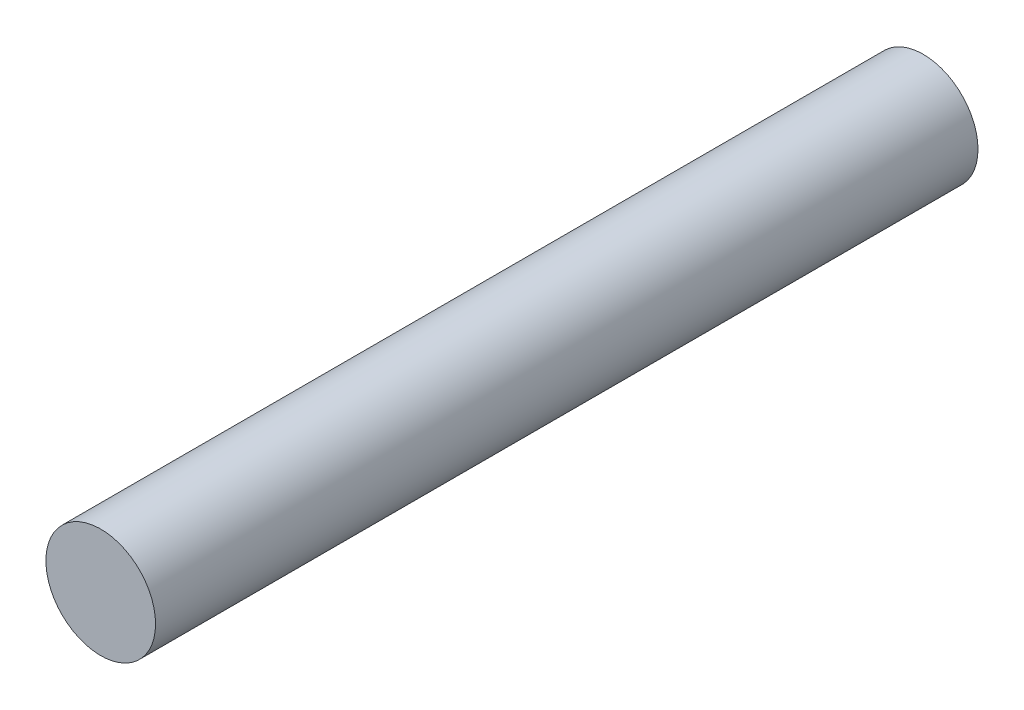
ISO-10303-21;
HEADER;
FILE_DESCRIPTION(('STEP AP214'),'2;1');
FILE_NAME('part.step','',(''),(''),'','','');
FILE_SCHEMA(('AUTOMOTIVE_DESIGN { 1 0 10303 214 1 1 1 1 }'));
ENDSEC;
DATA;
#1=APPLICATION_CONTEXT('core data for automotive mechanical design processes');
#2=APPLICATION_PROTOCOL_DEFINITION('international standard','automotive_design',2000,#1);
#3=PRODUCT_CONTEXT('',#1,'mechanical');
#4=PRODUCT('Part','Part','',(#3));
#5=PRODUCT_RELATED_PRODUCT_CATEGORY('part','',(#4));
#6=PRODUCT_DEFINITION_FORMATION('','',#4);
#7=PRODUCT_DEFINITION_CONTEXT('part definition',#1,'design');
#8=PRODUCT_DEFINITION('design','',#6,#7);
#9=PRODUCT_DEFINITION_SHAPE('','',#8);
#10=(LENGTH_UNIT() NAMED_UNIT(*) SI_UNIT(.MILLI.,.METRE.));
#11=(NAMED_UNIT(*) PLANE_ANGLE_UNIT() SI_UNIT($,.RADIAN.));
#12=(NAMED_UNIT(*) SI_UNIT($,.STERADIAN.) SOLID_ANGLE_UNIT());
#13=UNCERTAINTY_MEASURE_WITH_UNIT(LENGTH_MEASURE(1.E-05),#10,'distance_accuracy_value','');
#14=(GEOMETRIC_REPRESENTATION_CONTEXT(3) GLOBAL_UNCERTAINTY_ASSIGNED_CONTEXT((#13)) GLOBAL_UNIT_ASSIGNED_CONTEXT((#10,
#11,#12)) REPRESENTATION_CONTEXT('',''));
#15=CARTESIAN_POINT('',(0.,0.,0.));
#16=DIRECTION('',(0.,0.,1.));
#17=DIRECTION('',(1.,0.,0.));
#18=AXIS2_PLACEMENT_3D('',#15,#16,#17);
#19=CARTESIAN_POINT('',(0.,0.,300.));
#20=DIRECTION('',(0.,0.,-1.));
#21=DIRECTION('',(-1.,0.,0.));
#22=AXIS2_PLACEMENT_3D('',#19,#20,#21);
#23=CYLINDRICAL_SURFACE('',#22,20.);
#24=CARTESIAN_POINT('',(0.,0.,300.));
#25=DIRECTION('',(0.,0.,1.));
#26=DIRECTION('',(1.,0.,0.));
#27=AXIS2_PLACEMENT_3D('',#24,#25,#26);
#28=CIRCLE('',#27,20.);
#29=CARTESIAN_POINT('',(20.,0.,300.));
#30=VERTEX_POINT('',#29);
#31=EDGE_CURVE('E10',#30,#30,#28,.T.);
#32=ORIENTED_EDGE('',*,*,#31,.F.);
#33=EDGE_LOOP('',(#32));
#34=FACE_BOUND('',#33,.T.);
#35=CARTESIAN_POINT('',(0.,0.,0.));
#36=DIRECTION('',(0.,0.,1.));
#37=DIRECTION('',(1.,0.,0.));
#38=AXIS2_PLACEMENT_3D('',#35,#36,#37);
#39=CIRCLE('',#38,20.);
#40=CARTESIAN_POINT('',(20.,0.,0.));
#41=VERTEX_POINT('',#40);
#42=EDGE_CURVE('E32',#41,#41,#39,.T.);
#43=ORIENTED_EDGE('',*,*,#42,.T.);
#44=EDGE_LOOP('',(#43));
#45=FACE_BOUND('',#44,.T.);
#46=ADVANCED_FACE('F29',(#34,#45),#23,.T.);
#47=CARTESIAN_POINT('',(0.,0.,300.));
#48=DIRECTION('',(0.,0.,1.));
#49=DIRECTION('',(1.,0.,0.));
#50=AXIS2_PLACEMENT_3D('',#47,#48,#49);
#51=PLANE('',#50);
#52=ORIENTED_EDGE('',*,*,#31,.T.);
#53=EDGE_LOOP('',(#52));
#54=FACE_BOUND('',#53,.T.);
#55=ADVANCED_FACE('F44',(#54),#51,.T.);
#56=CARTESIAN_POINT('',(0.,0.,0.));
#57=DIRECTION('',(0.,0.,1.));
#58=DIRECTION('',(1.,0.,0.));
#59=AXIS2_PLACEMENT_3D('',#56,#57,#58);
#60=PLANE('',#59);
#61=ORIENTED_EDGE('',*,*,#42,.F.);
#62=EDGE_LOOP('',(#61));
#63=FACE_BOUND('',#62,.T.);
#64=ADVANCED_FACE('F42',(#63),#60,.F.);
#65=CLOSED_SHELL('',(#46,#55,#64));
#66=MANIFOLD_SOLID_BREP('B2',#65);
#67=ADVANCED_BREP_SHAPE_REPRESENTATION('',(#18,#66),#14);
#68=SHAPE_DEFINITION_REPRESENTATION(#9,#67);
ENDSEC;
END-ISO-10303-21;
